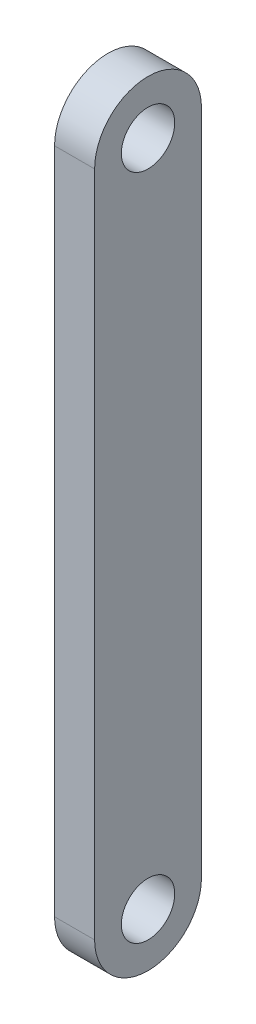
ISO-10303-21;
HEADER;
FILE_DESCRIPTION(('STEP AP214'),'2;1');
FILE_NAME('part.step','',(''),(''),'','','');
FILE_SCHEMA(('AUTOMOTIVE_DESIGN { 1 0 10303 214 1 1 1 1 }'));
ENDSEC;
DATA;
#1=APPLICATION_CONTEXT('core data for automotive mechanical design processes');
#2=APPLICATION_PROTOCOL_DEFINITION('international standard','automotive_design',2000,#1);
#3=PRODUCT_CONTEXT('',#1,'mechanical');
#4=PRODUCT('Part','Part','',(#3));
#5=PRODUCT_RELATED_PRODUCT_CATEGORY('part','',(#4));
#6=PRODUCT_DEFINITION_FORMATION('','',#4);
#7=PRODUCT_DEFINITION_CONTEXT('part definition',#1,'design');
#8=PRODUCT_DEFINITION('design','',#6,#7);
#9=PRODUCT_DEFINITION_SHAPE('','',#8);
#10=(LENGTH_UNIT() NAMED_UNIT(*) SI_UNIT(.MILLI.,.METRE.));
#11=(NAMED_UNIT(*) PLANE_ANGLE_UNIT() SI_UNIT($,.RADIAN.));
#12=(NAMED_UNIT(*) SI_UNIT($,.STERADIAN.) SOLID_ANGLE_UNIT());
#13=UNCERTAINTY_MEASURE_WITH_UNIT(LENGTH_MEASURE(1.E-05),#10,'distance_accuracy_value','');
#14=(GEOMETRIC_REPRESENTATION_CONTEXT(3) GLOBAL_UNCERTAINTY_ASSIGNED_CONTEXT((#13)) GLOBAL_UNIT_ASSIGNED_CONTEXT((#10,
#11,#12)) REPRESENTATION_CONTEXT('',''));
#15=CARTESIAN_POINT('',(0.,0.,0.));
#16=DIRECTION('',(0.,0.,1.));
#17=DIRECTION('',(1.,0.,0.));
#18=AXIS2_PLACEMENT_3D('',#15,#16,#17);
#19=CARTESIAN_POINT('',(3.,50.,0.));
#20=DIRECTION('',(1.,0.,0.));
#21=DIRECTION('',(0.,0.,-1.));
#22=AXIS2_PLACEMENT_3D('',#19,#20,#21);
#23=PLANE('',#22);
#24=CARTESIAN_POINT('',(3.,0.,0.));
#25=DIRECTION('',(1.,0.,0.));
#26=DIRECTION('',(0.,0.,-1.));
#27=AXIS2_PLACEMENT_3D('',#24,#25,#26);
#28=CIRCLE('',#27,2.);
#29=CARTESIAN_POINT('',(3.,0.,-2.));
#30=VERTEX_POINT('',#29);
#31=EDGE_CURVE('E99',#30,#30,#28,.T.);
#32=ORIENTED_EDGE('',*,*,#31,.F.);
#33=EDGE_LOOP('',(#32));
#34=FACE_BOUND('',#33,.T.);
#35=CARTESIAN_POINT('',(3.,50.,0.));
#36=DIRECTION('',(1.,0.,0.));
#37=DIRECTION('',(0.,0.,-1.));
#38=AXIS2_PLACEMENT_3D('',#35,#36,#37);
#39=CIRCLE('',#38,4.);
#40=CARTESIAN_POINT('',(3.,50.,-4.));
#41=VERTEX_POINT('',#40);
#42=CARTESIAN_POINT('',(3.,50.,4.));
#43=VERTEX_POINT('',#42);
#44=EDGE_CURVE('E84',#41,#43,#39,.T.);
#45=ORIENTED_EDGE('',*,*,#44,.T.);
#46=DIRECTION('',(0.,-1.,0.));
#47=VECTOR('',#46,1.);
#48=CARTESIAN_POINT('',(3.,50.,4.));
#49=LINE('',#48,#47);
#50=CARTESIAN_POINT('',(3.,0.,4.));
#51=VERTEX_POINT('',#50);
#52=EDGE_CURVE('E79',#43,#51,#49,.T.);
#53=ORIENTED_EDGE('',*,*,#52,.T.);
#54=CARTESIAN_POINT('',(3.,0.,0.));
#55=DIRECTION('',(1.,0.,0.));
#56=DIRECTION('',(0.,0.,1.));
#57=AXIS2_PLACEMENT_3D('',#54,#55,#56);
#58=CIRCLE('',#57,4.);
#59=CARTESIAN_POINT('',(3.,0.,-4.));
#60=VERTEX_POINT('',#59);
#61=EDGE_CURVE('E82',#51,#60,#58,.T.);
#62=ORIENTED_EDGE('',*,*,#61,.T.);
#63=DIRECTION('',(0.,1.,0.));
#64=VECTOR('',#63,1.);
#65=CARTESIAN_POINT('',(3.,50.,-4.));
#66=LINE('',#65,#64);
#67=EDGE_CURVE('E49',#60,#41,#66,.T.);
#68=ORIENTED_EDGE('',*,*,#67,.T.);
#69=EDGE_LOOP('',(#45,#53,#62,#68));
#70=FACE_BOUND('',#69,.T.);
#71=CARTESIAN_POINT('',(3.,50.,0.));
#72=DIRECTION('',(1.,0.,0.));
#73=DIRECTION('',(0.,0.,-1.));
#74=AXIS2_PLACEMENT_3D('',#71,#72,#73);
#75=CIRCLE('',#74,2.);
#76=CARTESIAN_POINT('',(3.,50.,-2.));
#77=VERTEX_POINT('',#76);
#78=EDGE_CURVE('E114',#77,#77,#75,.T.);
#79=ORIENTED_EDGE('',*,*,#78,.F.);
#80=EDGE_LOOP('',(#79));
#81=FACE_BOUND('',#80,.T.);
#82=ADVANCED_FACE('F32',(#34,#70,#81),#23,.T.);
#83=CARTESIAN_POINT('',(0.,50.,0.));
#84=DIRECTION('',(1.,0.,0.));
#85=DIRECTION('',(0.,0.,-1.));
#86=AXIS2_PLACEMENT_3D('',#83,#84,#85);
#87=PLANE('',#86);
#88=CARTESIAN_POINT('',(0.,0.,0.));
#89=DIRECTION('',(1.,0.,0.));
#90=DIRECTION('',(0.,0.,-1.));
#91=AXIS2_PLACEMENT_3D('',#88,#89,#90);
#92=CIRCLE('',#91,2.);
#93=CARTESIAN_POINT('',(0.,0.,-2.));
#94=VERTEX_POINT('',#93);
#95=EDGE_CURVE('E111',#94,#94,#92,.T.);
#96=ORIENTED_EDGE('',*,*,#95,.T.);
#97=EDGE_LOOP('',(#96));
#98=FACE_BOUND('',#97,.T.);
#99=CARTESIAN_POINT('',(0.,50.,0.));
#100=DIRECTION('',(1.,0.,0.));
#101=DIRECTION('',(0.,0.,-1.));
#102=AXIS2_PLACEMENT_3D('',#99,#100,#101);
#103=CIRCLE('',#102,4.);
#104=CARTESIAN_POINT('',(0.,50.,-4.));
#105=VERTEX_POINT('',#104);
#106=CARTESIAN_POINT('',(0.,50.,4.));
#107=VERTEX_POINT('',#106);
#108=EDGE_CURVE('E96',#105,#107,#103,.T.);
#109=ORIENTED_EDGE('',*,*,#108,.F.);
#110=DIRECTION('',(0.,1.,0.));
#111=VECTOR('',#110,1.);
#112=CARTESIAN_POINT('',(0.,50.,-4.));
#113=LINE('',#112,#111);
#114=CARTESIAN_POINT('',(0.,0.,-4.));
#115=VERTEX_POINT('',#114);
#116=EDGE_CURVE('E72',#115,#105,#113,.T.);
#117=ORIENTED_EDGE('',*,*,#116,.F.);
#118=CARTESIAN_POINT('',(0.,0.,0.));
#119=DIRECTION('',(1.,0.,0.));
#120=DIRECTION('',(0.,0.,1.));
#121=AXIS2_PLACEMENT_3D('',#118,#119,#120);
#122=CIRCLE('',#121,4.);
#123=CARTESIAN_POINT('',(0.,0.,4.));
#124=VERTEX_POINT('',#123);
#125=EDGE_CURVE('E66',#124,#115,#122,.T.);
#126=ORIENTED_EDGE('',*,*,#125,.F.);
#127=DIRECTION('',(0.,-1.,0.));
#128=VECTOR('',#127,1.);
#129=CARTESIAN_POINT('',(0.,50.,4.));
#130=LINE('',#129,#128);
#131=EDGE_CURVE('E88',#107,#124,#130,.T.);
#132=ORIENTED_EDGE('',*,*,#131,.F.);
#133=EDGE_LOOP('',(#109,#117,#126,#132));
#134=FACE_BOUND('',#133,.T.);
#135=CARTESIAN_POINT('',(0.,50.,0.));
#136=DIRECTION('',(1.,0.,0.));
#137=DIRECTION('',(0.,0.,-1.));
#138=AXIS2_PLACEMENT_3D('',#135,#136,#137);
#139=CIRCLE('',#138,2.);
#140=CARTESIAN_POINT('',(0.,50.,-2.));
#141=VERTEX_POINT('',#140);
#142=EDGE_CURVE('E117',#141,#141,#139,.T.);
#143=ORIENTED_EDGE('',*,*,#142,.T.);
#144=EDGE_LOOP('',(#143));
#145=FACE_BOUND('',#144,.T.);
#146=ADVANCED_FACE('F107',(#98,#134,#145),#87,.F.);
#147=CARTESIAN_POINT('',(3.,50.,0.));
#148=DIRECTION('',(-1.,0.,0.));
#149=DIRECTION('',(0.,0.,1.));
#150=AXIS2_PLACEMENT_3D('',#147,#148,#149);
#151=CYLINDRICAL_SURFACE('',#150,4.);
#152=ORIENTED_EDGE('',*,*,#108,.T.);
#153=DIRECTION('',(-1.,0.,0.));
#154=VECTOR('',#153,1.);
#155=CARTESIAN_POINT('',(3.,50.,4.));
#156=LINE('',#155,#154);
#157=EDGE_CURVE('E11',#43,#107,#156,.T.);
#158=ORIENTED_EDGE('',*,*,#157,.F.);
#159=ORIENTED_EDGE('',*,*,#44,.F.);
#160=DIRECTION('',(-1.,0.,0.));
#161=VECTOR('',#160,1.);
#162=CARTESIAN_POINT('',(3.,50.,-4.));
#163=LINE('',#162,#161);
#164=EDGE_CURVE('E92',#41,#105,#163,.T.);
#165=ORIENTED_EDGE('',*,*,#164,.T.);
#166=EDGE_LOOP('',(#152,#158,#159,#165));
#167=FACE_BOUND('',#166,.T.);
#168=ADVANCED_FACE('F34',(#167),#151,.T.);
#169=CARTESIAN_POINT('',(3.,50.,4.));
#170=DIRECTION('',(0.,0.,-1.));
#171=DIRECTION('',(0.,1.,0.));
#172=AXIS2_PLACEMENT_3D('',#169,#170,#171);
#173=PLANE('',#172);
#174=ORIENTED_EDGE('',*,*,#131,.T.);
#175=DIRECTION('',(-1.,0.,0.));
#176=VECTOR('',#175,1.);
#177=CARTESIAN_POINT('',(3.,0.,4.));
#178=LINE('',#177,#176);
#179=EDGE_CURVE('E41',#51,#124,#178,.T.);
#180=ORIENTED_EDGE('',*,*,#179,.F.);
#181=ORIENTED_EDGE('',*,*,#52,.F.);
#182=ORIENTED_EDGE('',*,*,#157,.T.);
#183=EDGE_LOOP('',(#174,#180,#181,#182));
#184=FACE_BOUND('',#183,.T.);
#185=ADVANCED_FACE('F87',(#184),#173,.F.);
#186=CARTESIAN_POINT('',(3.,0.,0.));
#187=DIRECTION('',(-1.,0.,0.));
#188=DIRECTION('',(0.,0.,1.));
#189=AXIS2_PLACEMENT_3D('',#186,#187,#188);
#190=CYLINDRICAL_SURFACE('',#189,4.);
#191=ORIENTED_EDGE('',*,*,#125,.T.);
#192=DIRECTION('',(-1.,0.,0.));
#193=VECTOR('',#192,1.);
#194=CARTESIAN_POINT('',(3.,0.,-4.));
#195=LINE('',#194,#193);
#196=EDGE_CURVE('E89',#60,#115,#195,.T.);
#197=ORIENTED_EDGE('',*,*,#196,.F.);
#198=ORIENTED_EDGE('',*,*,#61,.F.);
#199=ORIENTED_EDGE('',*,*,#179,.T.);
#200=EDGE_LOOP('',(#191,#197,#198,#199));
#201=FACE_BOUND('',#200,.T.);
#202=ADVANCED_FACE('F90',(#201),#190,.T.);
#203=CARTESIAN_POINT('',(3.,50.,-4.));
#204=DIRECTION('',(0.,0.,1.));
#205=DIRECTION('',(0.,-1.,0.));
#206=AXIS2_PLACEMENT_3D('',#203,#204,#205);
#207=PLANE('',#206);
#208=ORIENTED_EDGE('',*,*,#116,.T.);
#209=ORIENTED_EDGE('',*,*,#164,.F.);
#210=ORIENTED_EDGE('',*,*,#67,.F.);
#211=ORIENTED_EDGE('',*,*,#196,.T.);
#212=EDGE_LOOP('',(#208,#209,#210,#211));
#213=FACE_BOUND('',#212,.T.);
#214=ADVANCED_FACE('F104',(#213),#207,.F.);
#215=CARTESIAN_POINT('',(3.,0.,0.));
#216=DIRECTION('',(-1.,0.,0.));
#217=DIRECTION('',(0.,0.,1.));
#218=AXIS2_PLACEMENT_3D('',#215,#216,#217);
#219=CYLINDRICAL_SURFACE('',#218,2.);
#220=ORIENTED_EDGE('',*,*,#31,.T.);
#221=EDGE_LOOP('',(#220));
#222=FACE_BOUND('',#221,.T.);
#223=ORIENTED_EDGE('',*,*,#95,.F.);
#224=EDGE_LOOP('',(#223));
#225=FACE_BOUND('',#224,.T.);
#226=ADVANCED_FACE('F135',(#222,#225),#219,.F.);
#227=CARTESIAN_POINT('',(3.,50.,0.));
#228=DIRECTION('',(-1.,0.,0.));
#229=DIRECTION('',(0.,0.,1.));
#230=AXIS2_PLACEMENT_3D('',#227,#228,#229);
#231=CYLINDRICAL_SURFACE('',#230,2.);
#232=ORIENTED_EDGE('',*,*,#78,.T.);
#233=EDGE_LOOP('',(#232));
#234=FACE_BOUND('',#233,.T.);
#235=ORIENTED_EDGE('',*,*,#142,.F.);
#236=EDGE_LOOP('',(#235));
#237=FACE_BOUND('',#236,.T.);
#238=ADVANCED_FACE('F123',(#234,#237),#231,.F.);
#239=CLOSED_SHELL('',(#82,#146,#168,#185,#202,#214,#226,#238));
#240=MANIFOLD_SOLID_BREP('B2',#239);
#241=ADVANCED_BREP_SHAPE_REPRESENTATION('',(#18,#240),#14);
#242=SHAPE_DEFINITION_REPRESENTATION(#9,#241);
ENDSEC;
END-ISO-10303-21;
